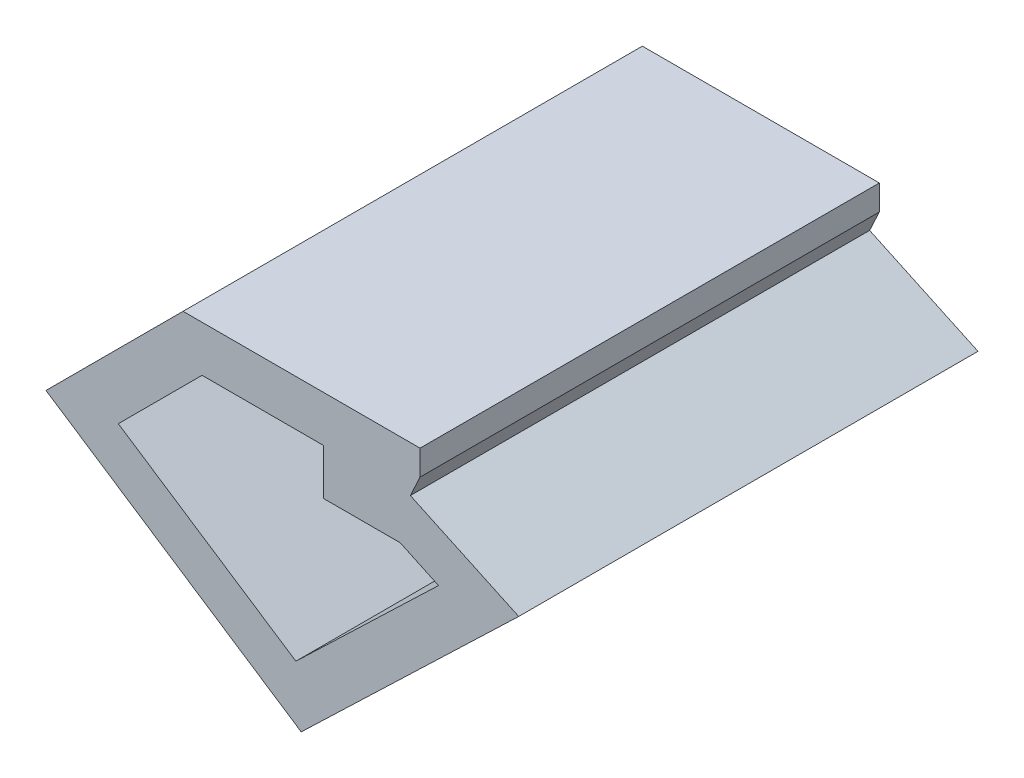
from build123d import *

# Parameters (mm, degrees)
BOSS_EXTRUDE1_DEPTH = 15


with BuildPart() as part:
    # Sketch2 → Boss-Extrude1 (new, symmetric)
    with BuildSketch(Plane.XY):
        Polygon((6.866072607, -1.359461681), (7.5, 0), (7.5, 1.640538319), (-7.980782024, 1.640538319), (-16.932871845, -7.311551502), (-0.263456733, -18.291375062), (13.944225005, -4.660058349), align=None)
        Polygon((-6.738141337, -1.359461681), (1.200988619, -1.359461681), (1.200988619, -4.359461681), (6.200988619, -4.359461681), (8.706519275, -5.527809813), (-0.612726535, -14.469000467), (-12.209263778, -6.830584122), align=None, mode=Mode.SUBTRACT)
    extrude(amount=BOSS_EXTRUDE1_DEPTH, both=True)


solid = part.part
